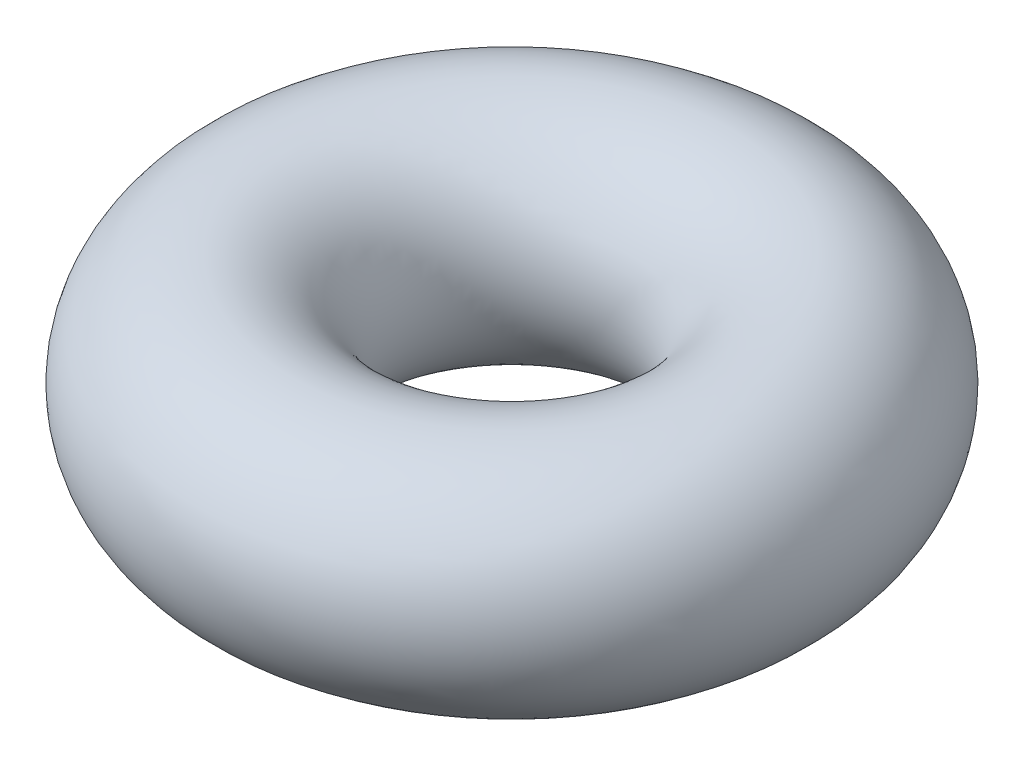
from build123d import *

# Parameters (mm, degrees)
SKETCH1_R = 0.762


with BuildPart() as part:
    # Sketch1 → Revolve1 (revolve)
    with BuildSketch(Plane.XY, mode=Mode.PRIVATE) as revolve1_sk:
        with Locations((1.4732, 0)):
            Circle(SKETCH1_R)
    revolve(revolve1_sk.sketch.rotate(Axis((0, -979.826032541, 0), (0, 1, 0)), 90), axis=Axis((0, -979.826032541, 0), (0, 1, 0)))


solid = part.part
